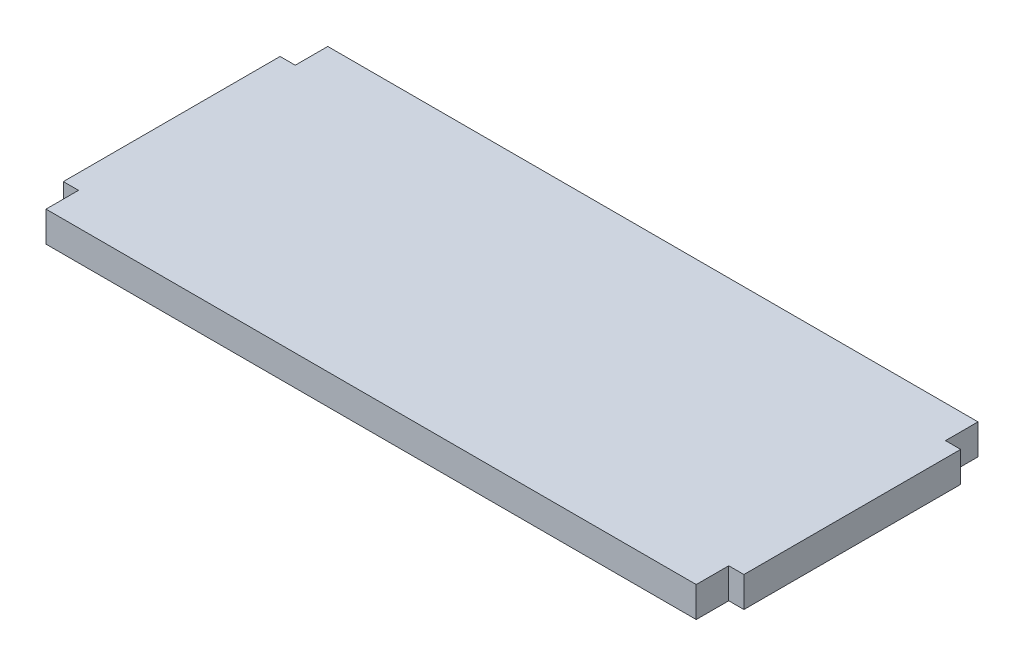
ISO-10303-21;
HEADER;
FILE_DESCRIPTION(('STEP AP214'),'2;1');
FILE_NAME('part.step','',(''),(''),'','','');
FILE_SCHEMA(('AUTOMOTIVE_DESIGN { 1 0 10303 214 1 1 1 1 }'));
ENDSEC;
DATA;
#1=APPLICATION_CONTEXT('core data for automotive mechanical design processes');
#2=APPLICATION_PROTOCOL_DEFINITION('international standard','automotive_design',2000,#1);
#3=PRODUCT_CONTEXT('',#1,'mechanical');
#4=PRODUCT('Part','Part','',(#3));
#5=PRODUCT_RELATED_PRODUCT_CATEGORY('part','',(#4));
#6=PRODUCT_DEFINITION_FORMATION('','',#4);
#7=PRODUCT_DEFINITION_CONTEXT('part definition',#1,'design');
#8=PRODUCT_DEFINITION('design','',#6,#7);
#9=PRODUCT_DEFINITION_SHAPE('','',#8);
#10=(LENGTH_UNIT() NAMED_UNIT(*) SI_UNIT(.MILLI.,.METRE.));
#11=(NAMED_UNIT(*) PLANE_ANGLE_UNIT() SI_UNIT($,.RADIAN.));
#12=(NAMED_UNIT(*) SI_UNIT($,.STERADIAN.) SOLID_ANGLE_UNIT());
#13=UNCERTAINTY_MEASURE_WITH_UNIT(LENGTH_MEASURE(1.E-05),#10,'distance_accuracy_value','');
#14=(GEOMETRIC_REPRESENTATION_CONTEXT(3) GLOBAL_UNCERTAINTY_ASSIGNED_CONTEXT((#13)) GLOBAL_UNIT_ASSIGNED_CONTEXT((#10,
#11,#12)) REPRESENTATION_CONTEXT('',''));
#15=CARTESIAN_POINT('',(0.,0.,0.));
#16=DIRECTION('',(0.,0.,1.));
#17=DIRECTION('',(1.,0.,0.));
#18=AXIS2_PLACEMENT_3D('',#15,#16,#17);
#19=CARTESIAN_POINT('',(0.,14.,115.));
#20=DIRECTION('',(0.,0.,-1.));
#21=DIRECTION('',(-1.,0.,0.));
#22=AXIS2_PLACEMENT_3D('',#19,#20,#21);
#23=PLANE('',#22);
#24=DIRECTION('',(1.,0.,0.));
#25=VECTOR('',#24,1.);
#26=CARTESIAN_POINT('',(0.,0.,115.));
#27=LINE('',#26,#25);
#28=CARTESIAN_POINT('',(0.,0.,115.));
#29=VERTEX_POINT('',#28);
#30=CARTESIAN_POINT('',(7.00000000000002,0.,115.));
#31=VERTEX_POINT('',#30);
#32=EDGE_CURVE('E153',#29,#31,#27,.T.);
#33=ORIENTED_EDGE('',*,*,#32,.T.);
#34=DIRECTION('',(0.,-1.,0.));
#35=VECTOR('',#34,1.);
#36=CARTESIAN_POINT('',(7.00000000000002,14.,115.));
#37=LINE('',#36,#35);
#38=CARTESIAN_POINT('',(7.00000000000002,14.,115.));
#39=VERTEX_POINT('',#38);
#40=EDGE_CURVE('E11',#39,#31,#37,.T.);
#41=ORIENTED_EDGE('',*,*,#40,.F.);
#42=DIRECTION('',(1.,0.,0.));
#43=VECTOR('',#42,1.);
#44=CARTESIAN_POINT('',(0.,14.,115.));
#45=LINE('',#44,#43);
#46=CARTESIAN_POINT('',(0.,14.,115.));
#47=VERTEX_POINT('',#46);
#48=EDGE_CURVE('E183',#47,#39,#45,.T.);
#49=ORIENTED_EDGE('',*,*,#48,.F.);
#50=DIRECTION('',(0.,-1.,0.));
#51=VECTOR('',#50,1.);
#52=CARTESIAN_POINT('',(0.,14.,115.));
#53=LINE('',#52,#51);
#54=EDGE_CURVE('E149',#47,#29,#53,.T.);
#55=ORIENTED_EDGE('',*,*,#54,.T.);
#56=EDGE_LOOP('',(#33,#41,#49,#55));
#57=FACE_BOUND('',#56,.T.);
#58=ADVANCED_FACE('F34',(#57),#23,.F.);
#59=CARTESIAN_POINT('',(7.00000000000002,14.,0.));
#60=DIRECTION('',(1.,0.,0.));
#61=DIRECTION('',(0.,0.,-1.));
#62=AXIS2_PLACEMENT_3D('',#59,#60,#61);
#63=PLANE('',#62);
#64=DIRECTION('',(0.,0.,1.));
#65=VECTOR('',#64,1.);
#66=CARTESIAN_POINT('',(7.00000000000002,0.,0.));
#67=LINE('',#66,#65);
#68=CARTESIAN_POINT('',(7.00000000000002,0.,130.));
#69=VERTEX_POINT('',#68);
#70=EDGE_CURVE('E156',#31,#69,#67,.T.);
#71=ORIENTED_EDGE('',*,*,#70,.T.);
#72=DIRECTION('',(0.,-1.,0.));
#73=VECTOR('',#72,1.);
#74=CARTESIAN_POINT('',(7.00000000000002,14.,130.));
#75=LINE('',#74,#73);
#76=CARTESIAN_POINT('',(7.00000000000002,14.,130.));
#77=VERTEX_POINT('',#76);
#78=EDGE_CURVE('E42',#77,#69,#75,.T.);
#79=ORIENTED_EDGE('',*,*,#78,.F.);
#80=DIRECTION('',(0.,0.,1.));
#81=VECTOR('',#80,1.);
#82=CARTESIAN_POINT('',(7.00000000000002,14.,0.));
#83=LINE('',#82,#81);
#84=EDGE_CURVE('E101',#39,#77,#83,.T.);
#85=ORIENTED_EDGE('',*,*,#84,.F.);
#86=ORIENTED_EDGE('',*,*,#40,.T.);
#87=EDGE_LOOP('',(#71,#79,#85,#86));
#88=FACE_BOUND('',#87,.T.);
#89=ADVANCED_FACE('F248',(#88),#63,.F.);
#90=CARTESIAN_POINT('',(0.,14.,130.));
#91=DIRECTION('',(0.,0.,-1.));
#92=DIRECTION('',(-1.,0.,0.));
#93=AXIS2_PLACEMENT_3D('',#90,#91,#92);
#94=PLANE('',#93);
#95=DIRECTION('',(1.,0.,0.));
#96=VECTOR('',#95,1.);
#97=CARTESIAN_POINT('',(0.,0.,130.));
#98=LINE('',#97,#96);
#99=CARTESIAN_POINT('',(307.,0.,130.));
#100=VERTEX_POINT('',#99);
#101=EDGE_CURVE('E158',#69,#100,#98,.T.);
#102=ORIENTED_EDGE('',*,*,#101,.T.);
#103=DIRECTION('',(0.,-1.,0.));
#104=VECTOR('',#103,1.);
#105=CARTESIAN_POINT('',(307.,14.,130.));
#106=LINE('',#105,#104);
#107=CARTESIAN_POINT('',(307.,14.,130.));
#108=VERTEX_POINT('',#107);
#109=EDGE_CURVE('E197',#108,#100,#106,.T.);
#110=ORIENTED_EDGE('',*,*,#109,.F.);
#111=DIRECTION('',(1.,0.,0.));
#112=VECTOR('',#111,1.);
#113=CARTESIAN_POINT('',(0.,14.,130.));
#114=LINE('',#113,#112);
#115=EDGE_CURVE('E204',#77,#108,#114,.T.);
#116=ORIENTED_EDGE('',*,*,#115,.F.);
#117=ORIENTED_EDGE('',*,*,#78,.T.);
#118=EDGE_LOOP('',(#102,#110,#116,#117));
#119=FACE_BOUND('',#118,.T.);
#120=ADVANCED_FACE('F202',(#119),#94,.F.);
#121=CARTESIAN_POINT('',(307.,14.,0.));
#122=DIRECTION('',(1.,0.,0.));
#123=DIRECTION('',(0.,0.,-1.));
#124=AXIS2_PLACEMENT_3D('',#121,#122,#123);
#125=PLANE('',#124);
#126=DIRECTION('',(0.,0.,1.));
#127=VECTOR('',#126,1.);
#128=CARTESIAN_POINT('',(307.,0.,0.));
#129=LINE('',#128,#127);
#130=CARTESIAN_POINT('',(307.,0.,115.));
#131=VERTEX_POINT('',#130);
#132=EDGE_CURVE('E161',#131,#100,#129,.T.);
#133=ORIENTED_EDGE('',*,*,#132,.F.);
#134=DIRECTION('',(0.,-1.,0.));
#135=VECTOR('',#134,1.);
#136=CARTESIAN_POINT('',(307.,14.,115.));
#137=LINE('',#136,#135);
#138=CARTESIAN_POINT('',(307.,14.,115.));
#139=VERTEX_POINT('',#138);
#140=EDGE_CURVE('E195',#139,#131,#137,.T.);
#141=ORIENTED_EDGE('',*,*,#140,.F.);
#142=DIRECTION('',(0.,0.,1.));
#143=VECTOR('',#142,1.);
#144=CARTESIAN_POINT('',(307.,14.,0.));
#145=LINE('',#144,#143);
#146=EDGE_CURVE('E215',#139,#108,#145,.T.);
#147=ORIENTED_EDGE('',*,*,#146,.T.);
#148=ORIENTED_EDGE('',*,*,#109,.T.);
#149=EDGE_LOOP('',(#133,#141,#147,#148));
#150=FACE_BOUND('',#149,.T.);
#151=ADVANCED_FACE('F211',(#150),#125,.T.);
#152=CARTESIAN_POINT('',(0.,14.,115.));
#153=DIRECTION('',(0.,0.,-1.));
#154=DIRECTION('',(-1.,0.,0.));
#155=AXIS2_PLACEMENT_3D('',#152,#153,#154);
#156=PLANE('',#155);
#157=DIRECTION('',(1.,0.,0.));
#158=VECTOR('',#157,1.);
#159=CARTESIAN_POINT('',(0.,0.,115.));
#160=LINE('',#159,#158);
#161=CARTESIAN_POINT('',(314.,0.,115.));
#162=VERTEX_POINT('',#161);
#163=EDGE_CURVE('E164',#131,#162,#160,.T.);
#164=ORIENTED_EDGE('',*,*,#163,.T.);
#165=DIRECTION('',(0.,-1.,0.));
#166=VECTOR('',#165,1.);
#167=CARTESIAN_POINT('',(314.,14.,115.));
#168=LINE('',#167,#166);
#169=CARTESIAN_POINT('',(314.,14.,115.));
#170=VERTEX_POINT('',#169);
#171=EDGE_CURVE('E193',#170,#162,#168,.T.);
#172=ORIENTED_EDGE('',*,*,#171,.F.);
#173=DIRECTION('',(1.,0.,0.));
#174=VECTOR('',#173,1.);
#175=CARTESIAN_POINT('',(0.,14.,115.));
#176=LINE('',#175,#174);
#177=EDGE_CURVE('E216',#139,#170,#176,.T.);
#178=ORIENTED_EDGE('',*,*,#177,.F.);
#179=ORIENTED_EDGE('',*,*,#140,.T.);
#180=EDGE_LOOP('',(#164,#172,#178,#179));
#181=FACE_BOUND('',#180,.T.);
#182=ADVANCED_FACE('F259',(#181),#156,.F.);
#183=CARTESIAN_POINT('',(314.,14.,0.));
#184=DIRECTION('',(1.,0.,0.));
#185=DIRECTION('',(0.,0.,-1.));
#186=AXIS2_PLACEMENT_3D('',#183,#184,#185);
#187=PLANE('',#186);
#188=DIRECTION('',(0.,0.,1.));
#189=VECTOR('',#188,1.);
#190=CARTESIAN_POINT('',(314.,0.,0.));
#191=LINE('',#190,#189);
#192=CARTESIAN_POINT('',(314.,0.,15.));
#193=VERTEX_POINT('',#192);
#194=EDGE_CURVE('E167',#193,#162,#191,.T.);
#195=ORIENTED_EDGE('',*,*,#194,.F.);
#196=DIRECTION('',(0.,-1.,0.));
#197=VECTOR('',#196,1.);
#198=CARTESIAN_POINT('',(314.,14.,15.));
#199=LINE('',#198,#197);
#200=CARTESIAN_POINT('',(314.,14.,15.));
#201=VERTEX_POINT('',#200);
#202=EDGE_CURVE('E191',#201,#193,#199,.T.);
#203=ORIENTED_EDGE('',*,*,#202,.F.);
#204=DIRECTION('',(0.,0.,1.));
#205=VECTOR('',#204,1.);
#206=CARTESIAN_POINT('',(314.,14.,0.));
#207=LINE('',#206,#205);
#208=EDGE_CURVE('E218',#201,#170,#207,.T.);
#209=ORIENTED_EDGE('',*,*,#208,.T.);
#210=ORIENTED_EDGE('',*,*,#171,.T.);
#211=EDGE_LOOP('',(#195,#203,#209,#210));
#212=FACE_BOUND('',#211,.T.);
#213=ADVANCED_FACE('F262',(#212),#187,.T.);
#214=CARTESIAN_POINT('',(0.,14.,15.));
#215=DIRECTION('',(0.,0.,-1.));
#216=DIRECTION('',(-1.,0.,0.));
#217=AXIS2_PLACEMENT_3D('',#214,#215,#216);
#218=PLANE('',#217);
#219=DIRECTION('',(1.,0.,0.));
#220=VECTOR('',#219,1.);
#221=CARTESIAN_POINT('',(0.,0.,15.));
#222=LINE('',#221,#220);
#223=CARTESIAN_POINT('',(307.,0.,15.));
#224=VERTEX_POINT('',#223);
#225=EDGE_CURVE('E170',#224,#193,#222,.T.);
#226=ORIENTED_EDGE('',*,*,#225,.F.);
#227=DIRECTION('',(0.,-1.,0.));
#228=VECTOR('',#227,1.);
#229=CARTESIAN_POINT('',(307.,14.,15.));
#230=LINE('',#229,#228);
#231=CARTESIAN_POINT('',(307.,14.,15.));
#232=VERTEX_POINT('',#231);
#233=EDGE_CURVE('E189',#232,#224,#230,.T.);
#234=ORIENTED_EDGE('',*,*,#233,.F.);
#235=DIRECTION('',(1.,0.,0.));
#236=VECTOR('',#235,1.);
#237=CARTESIAN_POINT('',(0.,14.,15.));
#238=LINE('',#237,#236);
#239=EDGE_CURVE('E225',#232,#201,#238,.T.);
#240=ORIENTED_EDGE('',*,*,#239,.T.);
#241=ORIENTED_EDGE('',*,*,#202,.T.);
#242=EDGE_LOOP('',(#226,#234,#240,#241));
#243=FACE_BOUND('',#242,.T.);
#244=ADVANCED_FACE('F266',(#243),#218,.T.);
#245=CARTESIAN_POINT('',(307.,14.,0.));
#246=DIRECTION('',(1.,0.,0.));
#247=DIRECTION('',(0.,0.,-1.));
#248=AXIS2_PLACEMENT_3D('',#245,#246,#247);
#249=PLANE('',#248);
#250=DIRECTION('',(0.,0.,1.));
#251=VECTOR('',#250,1.);
#252=CARTESIAN_POINT('',(307.,0.,0.));
#253=LINE('',#252,#251);
#254=CARTESIAN_POINT('',(307.,0.,0.));
#255=VERTEX_POINT('',#254);
#256=EDGE_CURVE('E173',#255,#224,#253,.T.);
#257=ORIENTED_EDGE('',*,*,#256,.F.);
#258=DIRECTION('',(0.,-1.,0.));
#259=VECTOR('',#258,1.);
#260=CARTESIAN_POINT('',(307.,14.,0.));
#261=LINE('',#260,#259);
#262=CARTESIAN_POINT('',(307.,14.,0.));
#263=VERTEX_POINT('',#262);
#264=EDGE_CURVE('E187',#263,#255,#261,.T.);
#265=ORIENTED_EDGE('',*,*,#264,.F.);
#266=DIRECTION('',(0.,0.,1.));
#267=VECTOR('',#266,1.);
#268=CARTESIAN_POINT('',(307.,14.,0.));
#269=LINE('',#268,#267);
#270=EDGE_CURVE('E228',#263,#232,#269,.T.);
#271=ORIENTED_EDGE('',*,*,#270,.T.);
#272=ORIENTED_EDGE('',*,*,#233,.T.);
#273=EDGE_LOOP('',(#257,#265,#271,#272));
#274=FACE_BOUND('',#273,.T.);
#275=ADVANCED_FACE('F270',(#274),#249,.T.);
#276=CARTESIAN_POINT('',(0.,14.,0.));
#277=DIRECTION('',(0.,0.,-1.));
#278=DIRECTION('',(-1.,0.,0.));
#279=AXIS2_PLACEMENT_3D('',#276,#277,#278);
#280=PLANE('',#279);
#281=DIRECTION('',(1.,0.,0.));
#282=VECTOR('',#281,1.);
#283=CARTESIAN_POINT('',(0.,0.,0.));
#284=LINE('',#283,#282);
#285=CARTESIAN_POINT('',(7.00000000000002,0.,0.));
#286=VERTEX_POINT('',#285);
#287=EDGE_CURVE('E176',#286,#255,#284,.T.);
#288=ORIENTED_EDGE('',*,*,#287,.F.);
#289=DIRECTION('',(0.,-1.,0.));
#290=VECTOR('',#289,1.);
#291=CARTESIAN_POINT('',(7.00000000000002,14.,0.));
#292=LINE('',#291,#290);
#293=CARTESIAN_POINT('',(7.00000000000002,14.,0.));
#294=VERTEX_POINT('',#293);
#295=EDGE_CURVE('E145',#294,#286,#292,.T.);
#296=ORIENTED_EDGE('',*,*,#295,.F.);
#297=DIRECTION('',(1.,0.,0.));
#298=VECTOR('',#297,1.);
#299=CARTESIAN_POINT('',(0.,14.,0.));
#300=LINE('',#299,#298);
#301=EDGE_CURVE('E134',#294,#263,#300,.T.);
#302=ORIENTED_EDGE('',*,*,#301,.T.);
#303=ORIENTED_EDGE('',*,*,#264,.T.);
#304=EDGE_LOOP('',(#288,#296,#302,#303));
#305=FACE_BOUND('',#304,.T.);
#306=ADVANCED_FACE('F232',(#305),#280,.T.);
#307=CARTESIAN_POINT('',(7.00000000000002,14.,0.));
#308=DIRECTION('',(1.,0.,0.));
#309=DIRECTION('',(0.,0.,-1.));
#310=AXIS2_PLACEMENT_3D('',#307,#308,#309);
#311=PLANE('',#310);
#312=DIRECTION('',(0.,0.,1.));
#313=VECTOR('',#312,1.);
#314=CARTESIAN_POINT('',(7.00000000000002,0.,0.));
#315=LINE('',#314,#313);
#316=CARTESIAN_POINT('',(7.00000000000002,0.,15.));
#317=VERTEX_POINT('',#316);
#318=EDGE_CURVE('E141',#286,#317,#315,.T.);
#319=ORIENTED_EDGE('',*,*,#318,.T.);
#320=DIRECTION('',(0.,-1.,0.));
#321=VECTOR('',#320,1.);
#322=CARTESIAN_POINT('',(7.00000000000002,14.,15.));
#323=LINE('',#322,#321);
#324=CARTESIAN_POINT('',(7.00000000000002,14.,15.));
#325=VERTEX_POINT('',#324);
#326=EDGE_CURVE('E138',#325,#317,#323,.T.);
#327=ORIENTED_EDGE('',*,*,#326,.F.);
#328=DIRECTION('',(0.,0.,1.));
#329=VECTOR('',#328,1.);
#330=CARTESIAN_POINT('',(7.00000000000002,14.,0.));
#331=LINE('',#330,#329);
#332=EDGE_CURVE('E127',#294,#325,#331,.T.);
#333=ORIENTED_EDGE('',*,*,#332,.F.);
#334=ORIENTED_EDGE('',*,*,#295,.T.);
#335=EDGE_LOOP('',(#319,#327,#333,#334));
#336=FACE_BOUND('',#335,.T.);
#337=ADVANCED_FACE('F139',(#336),#311,.F.);
#338=CARTESIAN_POINT('',(0.,14.,15.));
#339=DIRECTION('',(0.,0.,-1.));
#340=DIRECTION('',(-1.,0.,0.));
#341=AXIS2_PLACEMENT_3D('',#338,#339,#340);
#342=PLANE('',#341);
#343=DIRECTION('',(1.,0.,0.));
#344=VECTOR('',#343,1.);
#345=CARTESIAN_POINT('',(0.,0.,15.));
#346=LINE('',#345,#344);
#347=CARTESIAN_POINT('',(0.,0.,15.));
#348=VERTEX_POINT('',#347);
#349=EDGE_CURVE('E180',#348,#317,#346,.T.);
#350=ORIENTED_EDGE('',*,*,#349,.F.);
#351=DIRECTION('',(0.,-1.,0.));
#352=VECTOR('',#351,1.);
#353=CARTESIAN_POINT('',(0.,14.,15.));
#354=LINE('',#353,#352);
#355=CARTESIAN_POINT('',(0.,14.,15.));
#356=VERTEX_POINT('',#355);
#357=EDGE_CURVE('E90',#356,#348,#354,.T.);
#358=ORIENTED_EDGE('',*,*,#357,.F.);
#359=DIRECTION('',(1.,0.,0.));
#360=VECTOR('',#359,1.);
#361=CARTESIAN_POINT('',(0.,14.,15.));
#362=LINE('',#361,#360);
#363=EDGE_CURVE('E131',#356,#325,#362,.T.);
#364=ORIENTED_EDGE('',*,*,#363,.T.);
#365=ORIENTED_EDGE('',*,*,#326,.T.);
#366=EDGE_LOOP('',(#350,#358,#364,#365));
#367=FACE_BOUND('',#366,.T.);
#368=ADVANCED_FACE('F147',(#367),#342,.T.);
#369=CARTESIAN_POINT('',(0.,14.,0.));
#370=DIRECTION('',(1.,0.,0.));
#371=DIRECTION('',(0.,0.,-1.));
#372=AXIS2_PLACEMENT_3D('',#369,#370,#371);
#373=PLANE('',#372);
#374=DIRECTION('',(0.,0.,1.));
#375=VECTOR('',#374,1.);
#376=CARTESIAN_POINT('',(0.,0.,0.));
#377=LINE('',#376,#375);
#378=EDGE_CURVE('E93',#348,#29,#377,.T.);
#379=ORIENTED_EDGE('',*,*,#378,.T.);
#380=ORIENTED_EDGE('',*,*,#54,.F.);
#381=DIRECTION('',(0.,0.,1.));
#382=VECTOR('',#381,1.);
#383=CARTESIAN_POINT('',(0.,14.,0.));
#384=LINE('',#383,#382);
#385=EDGE_CURVE('E50',#356,#47,#384,.T.);
#386=ORIENTED_EDGE('',*,*,#385,.F.);
#387=ORIENTED_EDGE('',*,*,#357,.T.);
#388=EDGE_LOOP('',(#379,#380,#386,#387));
#389=FACE_BOUND('',#388,.T.);
#390=ADVANCED_FACE('F237',(#389),#373,.F.);
#391=CARTESIAN_POINT('',(0.,14.,0.));
#392=DIRECTION('',(0.,1.,0.));
#393=DIRECTION('',(0.,0.,1.));
#394=AXIS2_PLACEMENT_3D('',#391,#392,#393);
#395=PLANE('',#394);
#396=ORIENTED_EDGE('',*,*,#48,.T.);
#397=ORIENTED_EDGE('',*,*,#84,.T.);
#398=ORIENTED_EDGE('',*,*,#115,.T.);
#399=ORIENTED_EDGE('',*,*,#146,.F.);
#400=ORIENTED_EDGE('',*,*,#177,.T.);
#401=ORIENTED_EDGE('',*,*,#208,.F.);
#402=ORIENTED_EDGE('',*,*,#239,.F.);
#403=ORIENTED_EDGE('',*,*,#270,.F.);
#404=ORIENTED_EDGE('',*,*,#301,.F.);
#405=ORIENTED_EDGE('',*,*,#332,.T.);
#406=ORIENTED_EDGE('',*,*,#363,.F.);
#407=ORIENTED_EDGE('',*,*,#385,.T.);
#408=EDGE_LOOP('',(#396,#397,#398,#399,#400,#401,#402,#403,#404,#405,#406,#407));
#409=FACE_BOUND('',#408,.T.);
#410=ADVANCED_FACE('F129',(#409),#395,.T.);
#411=CARTESIAN_POINT('',(0.,0.,0.));
#412=DIRECTION('',(0.,1.,0.));
#413=DIRECTION('',(0.,0.,1.));
#414=AXIS2_PLACEMENT_3D('',#411,#412,#413);
#415=PLANE('',#414);
#416=ORIENTED_EDGE('',*,*,#32,.F.);
#417=ORIENTED_EDGE('',*,*,#378,.F.);
#418=ORIENTED_EDGE('',*,*,#349,.T.);
#419=ORIENTED_EDGE('',*,*,#318,.F.);
#420=ORIENTED_EDGE('',*,*,#287,.T.);
#421=ORIENTED_EDGE('',*,*,#256,.T.);
#422=ORIENTED_EDGE('',*,*,#225,.T.);
#423=ORIENTED_EDGE('',*,*,#194,.T.);
#424=ORIENTED_EDGE('',*,*,#163,.F.);
#425=ORIENTED_EDGE('',*,*,#132,.T.);
#426=ORIENTED_EDGE('',*,*,#101,.F.);
#427=ORIENTED_EDGE('',*,*,#70,.F.);
#428=EDGE_LOOP('',(#416,#417,#418,#419,#420,#421,#422,#423,#424,#425,#426,#427));
#429=FACE_BOUND('',#428,.T.);
#430=ADVANCED_FACE('F207',(#429),#415,.F.);
#431=CLOSED_SHELL('',(#58,#89,#120,#151,#182,#213,#244,#275,#306,#337,#368,#390,#410,#430));
#432=MANIFOLD_SOLID_BREP('B2',#431);
#433=ADVANCED_BREP_SHAPE_REPRESENTATION('',(#18,#432),#14);
#434=SHAPE_DEFINITION_REPRESENTATION(#9,#433);
ENDSEC;
END-ISO-10303-21;
